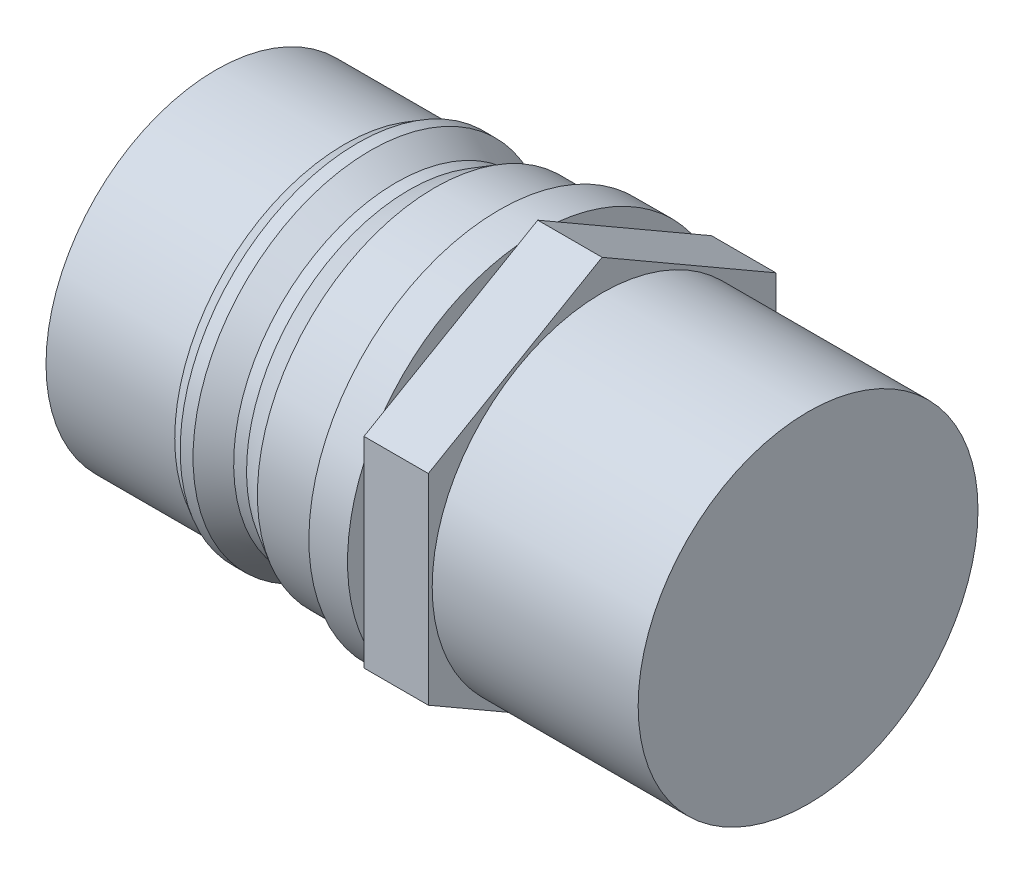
ISO-10303-21;
HEADER;
FILE_DESCRIPTION(('STEP AP214'),'2;1');
FILE_NAME('part.step','',(''),(''),'','','');
FILE_SCHEMA(('AUTOMOTIVE_DESIGN { 1 0 10303 214 1 1 1 1 }'));
ENDSEC;
DATA;
#1=APPLICATION_CONTEXT('core data for automotive mechanical design processes');
#2=APPLICATION_PROTOCOL_DEFINITION('international standard','automotive_design',2000,#1);
#3=PRODUCT_CONTEXT('',#1,'mechanical');
#4=PRODUCT('Part','Part','',(#3));
#5=PRODUCT_RELATED_PRODUCT_CATEGORY('part','',(#4));
#6=PRODUCT_DEFINITION_FORMATION('','',#4);
#7=PRODUCT_DEFINITION_CONTEXT('part definition',#1,'design');
#8=PRODUCT_DEFINITION('design','',#6,#7);
#9=PRODUCT_DEFINITION_SHAPE('','',#8);
#10=(LENGTH_UNIT() NAMED_UNIT(*) SI_UNIT(.MILLI.,.METRE.));
#11=(NAMED_UNIT(*) PLANE_ANGLE_UNIT() SI_UNIT($,.RADIAN.));
#12=(NAMED_UNIT(*) SI_UNIT($,.STERADIAN.) SOLID_ANGLE_UNIT());
#13=UNCERTAINTY_MEASURE_WITH_UNIT(LENGTH_MEASURE(1.E-05),#10,'distance_accuracy_value','');
#14=(GEOMETRIC_REPRESENTATION_CONTEXT(3) GLOBAL_UNCERTAINTY_ASSIGNED_CONTEXT((#13)) GLOBAL_UNIT_ASSIGNED_CONTEXT((#10,
#11,#12)) REPRESENTATION_CONTEXT('',''));
#15=CARTESIAN_POINT('',(0.,0.,0.));
#16=DIRECTION('',(0.,0.,1.));
#17=DIRECTION('',(1.,0.,0.));
#18=AXIS2_PLACEMENT_3D('',#15,#16,#17);
#19=CARTESIAN_POINT('',(25.,14.7773502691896,0.));
#20=DIRECTION('',(1.,0.,0.));
#21=DIRECTION('',(0.,1.,0.));
#22=AXIS2_PLACEMENT_3D('',#19,#20,#21);
#23=PLANE('',#22);
#24=DIRECTION('',(0.,0.5,0.866025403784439));
#25=VECTOR('',#24,1.);
#26=CARTESIAN_POINT('',(25.,7.79422863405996,-13.5));
#27=LINE('',#26,#25);
#28=CARTESIAN_POINT('',(25.,8.68634374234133,-11.9548113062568));
#29=VERTEX_POINT('',#28);
#30=CARTESIAN_POINT('',(25.,14.6963421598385,-1.54518869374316));
#31=VERTEX_POINT('',#30);
#32=EDGE_CURVE('E11',#29,#31,#27,.T.);
#33=ORIENTED_EDGE('',*,*,#32,.F.);
#34=CARTESIAN_POINT('',(25.,0.,0.));
#35=DIRECTION('',(1.,0.,0.));
#36=DIRECTION('',(0.,1.,0.));
#37=AXIS2_PLACEMENT_3D('',#34,#35,#36);
#38=CIRCLE('',#37,14.7773502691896);
#39=EDGE_CURVE('E152',#29,#31,#38,.T.);
#40=ORIENTED_EDGE('',*,*,#39,.T.);
#41=EDGE_LOOP('',(#33,#40));
#42=FACE_BOUND('',#41,.T.);
#43=ADVANCED_FACE('F33',(#42),#23,.T.);
#44=DIRECTION('',(0.,1.,0.));
#45=VECTOR('',#44,1.);
#46=CARTESIAN_POINT('',(25.,-7.79422863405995,-13.5));
#47=LINE('',#46,#45);
#48=CARTESIAN_POINT('',(25.,-6.0099984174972,-13.5));
#49=VERTEX_POINT('',#48);
#50=CARTESIAN_POINT('',(25.,6.00999841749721,-13.5));
#51=VERTEX_POINT('',#50);
#52=EDGE_CURVE('E42',#49,#51,#47,.T.);
#53=ORIENTED_EDGE('',*,*,#52,.F.);
#54=EDGE_CURVE('E316',#49,#51,#38,.T.);
#55=ORIENTED_EDGE('',*,*,#54,.T.);
#56=EDGE_LOOP('',(#53,#55));
#57=FACE_BOUND('',#56,.T.);
#58=ADVANCED_FACE('F226',(#57),#23,.T.);
#59=DIRECTION('',(0.,0.5,-0.866025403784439));
#60=VECTOR('',#59,1.);
#61=CARTESIAN_POINT('',(25.,-15.5884572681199,0.));
#62=LINE('',#61,#60);
#63=CARTESIAN_POINT('',(25.,-14.6963421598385,-1.54518869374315));
#64=VERTEX_POINT('',#63);
#65=CARTESIAN_POINT('',(25.,-8.68634374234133,-11.9548113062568));
#66=VERTEX_POINT('',#65);
#67=EDGE_CURVE('E284',#64,#66,#62,.T.);
#68=ORIENTED_EDGE('',*,*,#67,.F.);
#69=EDGE_CURVE('E307',#64,#66,#38,.T.);
#70=ORIENTED_EDGE('',*,*,#69,.T.);
#71=EDGE_LOOP('',(#68,#70));
#72=FACE_BOUND('',#71,.T.);
#73=ADVANCED_FACE('F232',(#72),#23,.T.);
#74=DIRECTION('',(0.,-0.5,-0.866025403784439));
#75=VECTOR('',#74,1.);
#76=CARTESIAN_POINT('',(25.,-7.79422863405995,13.5));
#77=LINE('',#76,#75);
#78=CARTESIAN_POINT('',(25.,-8.68634374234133,11.9548113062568));
#79=VERTEX_POINT('',#78);
#80=CARTESIAN_POINT('',(25.,-14.6963421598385,1.54518869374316));
#81=VERTEX_POINT('',#80);
#82=EDGE_CURVE('E194',#79,#81,#77,.T.);
#83=ORIENTED_EDGE('',*,*,#82,.F.);
#84=EDGE_CURVE('E302',#79,#81,#38,.T.);
#85=ORIENTED_EDGE('',*,*,#84,.T.);
#86=EDGE_LOOP('',(#83,#85));
#87=FACE_BOUND('',#86,.T.);
#88=ADVANCED_FACE('F252',(#87),#23,.T.);
#89=DIRECTION('',(0.,-1.,0.));
#90=VECTOR('',#89,1.);
#91=CARTESIAN_POINT('',(25.,7.79422863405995,13.5));
#92=LINE('',#91,#90);
#93=CARTESIAN_POINT('',(25.,6.0099984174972,13.5));
#94=VERTEX_POINT('',#93);
#95=CARTESIAN_POINT('',(25.,-6.0099984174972,13.5));
#96=VERTEX_POINT('',#95);
#97=EDGE_CURVE('E189',#94,#96,#92,.T.);
#98=ORIENTED_EDGE('',*,*,#97,.F.);
#99=EDGE_CURVE('E263',#94,#96,#38,.T.);
#100=ORIENTED_EDGE('',*,*,#99,.T.);
#101=EDGE_LOOP('',(#98,#100));
#102=FACE_BOUND('',#101,.T.);
#103=ADVANCED_FACE('F240',(#102),#23,.T.);
#104=CARTESIAN_POINT('',(0.,0.,0.));
#105=DIRECTION('',(-1.,0.,0.));
#106=DIRECTION('',(0.,-1.,0.));
#107=AXIS2_PLACEMENT_3D('',#104,#105,#106);
#108=PLANE('',#107);
#109=CARTESIAN_POINT('',(0.,0.,0.));
#110=DIRECTION('',(1.,0.,0.));
#111=DIRECTION('',(0.,1.,0.));
#112=AXIS2_PLACEMENT_3D('',#109,#110,#111);
#113=CIRCLE('',#112,13.2);
#114=CARTESIAN_POINT('',(0.,13.2,0.));
#115=VERTEX_POINT('',#114);
#116=EDGE_CURVE('E37',#115,#115,#113,.T.);
#117=ORIENTED_EDGE('',*,*,#116,.F.);
#118=EDGE_LOOP('',(#117));
#119=FACE_BOUND('',#118,.T.);
#120=ADVANCED_FACE('F35',(#119),#108,.T.);
#121=CARTESIAN_POINT('',(25.,0.,0.));
#122=DIRECTION('',(1.,0.,0.));
#123=DIRECTION('',(0.,1.,0.));
#124=AXIS2_PLACEMENT_3D('',#121,#122,#123);
#125=CYLINDRICAL_SURFACE('',#124,13.2);
#126=ORIENTED_EDGE('',*,*,#116,.T.);
#127=EDGE_LOOP('',(#126));
#128=FACE_BOUND('',#127,.T.);
#129=CARTESIAN_POINT('',(10.,0.,0.));
#130=DIRECTION('',(1.,0.,0.));
#131=DIRECTION('',(0.,1.,0.));
#132=AXIS2_PLACEMENT_3D('',#129,#130,#131);
#133=CIRCLE('',#132,13.2);
#134=CARTESIAN_POINT('',(10.,13.2,0.));
#135=VERTEX_POINT('',#134);
#136=EDGE_CURVE('E180',#135,#135,#133,.T.);
#137=ORIENTED_EDGE('',*,*,#136,.F.);
#138=EDGE_LOOP('',(#137));
#139=FACE_BOUND('',#138,.T.);
#140=ADVANCED_FACE('F258',(#128,#139),#125,.T.);
#141=CARTESIAN_POINT('',(11.,0.,0.));
#142=DIRECTION('',(1.,0.,0.));
#143=DIRECTION('',(0.,1.,0.));
#144=AXIS2_PLACEMENT_3D('',#141,#142,#143);
#145=CONICAL_SURFACE('',#144,13.7773502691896,0.523598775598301);
#146=ORIENTED_EDGE('',*,*,#136,.T.);
#147=EDGE_LOOP('',(#146));
#148=FACE_BOUND('',#147,.T.);
#149=CARTESIAN_POINT('',(11.,0.,0.));
#150=DIRECTION('',(1.,0.,0.));
#151=DIRECTION('',(0.,1.,0.));
#152=AXIS2_PLACEMENT_3D('',#149,#150,#151);
#153=CIRCLE('',#152,13.7773502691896);
#154=CARTESIAN_POINT('',(11.,13.7773502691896,0.));
#155=VERTEX_POINT('',#154);
#156=EDGE_CURVE('E178',#155,#155,#153,.T.);
#157=ORIENTED_EDGE('',*,*,#156,.F.);
#158=EDGE_LOOP('',(#157));
#159=FACE_BOUND('',#158,.T.);
#160=ADVANCED_FACE('F525',(#148,#159),#145,.T.);
#161=CARTESIAN_POINT('',(25.,0.,0.));
#162=DIRECTION('',(1.,0.,0.));
#163=DIRECTION('',(0.,1.,0.));
#164=AXIS2_PLACEMENT_3D('',#161,#162,#163);
#165=CYLINDRICAL_SURFACE('',#164,13.7773502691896);
#166=ORIENTED_EDGE('',*,*,#156,.T.);
#167=EDGE_LOOP('',(#166));
#168=FACE_BOUND('',#167,.T.);
#169=CARTESIAN_POINT('',(12.,0.,0.));
#170=DIRECTION('',(1.,0.,0.));
#171=DIRECTION('',(0.,1.,0.));
#172=AXIS2_PLACEMENT_3D('',#169,#170,#171);
#173=CIRCLE('',#172,13.7773502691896);
#174=CARTESIAN_POINT('',(12.,13.7773502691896,0.));
#175=VERTEX_POINT('',#174);
#176=EDGE_CURVE('E175',#175,#175,#173,.T.);
#177=ORIENTED_EDGE('',*,*,#176,.F.);
#178=EDGE_LOOP('',(#177));
#179=FACE_BOUND('',#178,.T.);
#180=ADVANCED_FACE('F514',(#168,#179),#165,.T.);
#181=CARTESIAN_POINT('',(14.,0.,0.));
#182=DIRECTION('',(-1.,0.,0.));
#183=DIRECTION('',(0.,-1.,0.));
#184=AXIS2_PLACEMENT_3D('',#181,#182,#183);
#185=CONICAL_SURFACE('',#184,12.6226497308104,0.5235987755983);
#186=ORIENTED_EDGE('',*,*,#176,.T.);
#187=EDGE_LOOP('',(#186));
#188=FACE_BOUND('',#187,.T.);
#189=CARTESIAN_POINT('',(14.,0.,0.));
#190=DIRECTION('',(1.,0.,0.));
#191=DIRECTION('',(0.,1.,0.));
#192=AXIS2_PLACEMENT_3D('',#189,#190,#191);
#193=CIRCLE('',#192,12.6226497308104);
#194=CARTESIAN_POINT('',(14.,12.6226497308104,0.));
#195=VERTEX_POINT('',#194);
#196=EDGE_CURVE('E172',#195,#195,#193,.T.);
#197=ORIENTED_EDGE('',*,*,#196,.F.);
#198=EDGE_LOOP('',(#197));
#199=FACE_BOUND('',#198,.T.);
#200=ADVANCED_FACE('F504',(#188,#199),#185,.T.);
#201=CARTESIAN_POINT('',(25.,0.,0.));
#202=DIRECTION('',(1.,0.,0.));
#203=DIRECTION('',(0.,1.,0.));
#204=AXIS2_PLACEMENT_3D('',#201,#202,#203);
#205=CYLINDRICAL_SURFACE('',#204,12.6226497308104);
#206=ORIENTED_EDGE('',*,*,#196,.T.);
#207=EDGE_LOOP('',(#206));
#208=FACE_BOUND('',#207,.T.);
#209=CARTESIAN_POINT('',(15.,0.,0.));
#210=DIRECTION('',(1.,0.,0.));
#211=DIRECTION('',(0.,1.,0.));
#212=AXIS2_PLACEMENT_3D('',#209,#210,#211);
#213=CIRCLE('',#212,12.6226497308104);
#214=CARTESIAN_POINT('',(15.,12.6226497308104,0.));
#215=VERTEX_POINT('',#214);
#216=EDGE_CURVE('E169',#215,#215,#213,.T.);
#217=ORIENTED_EDGE('',*,*,#216,.F.);
#218=EDGE_LOOP('',(#217));
#219=FACE_BOUND('',#218,.T.);
#220=ADVANCED_FACE('F492',(#208,#219),#205,.T.);
#221=CARTESIAN_POINT('',(17.,0.,0.));
#222=DIRECTION('',(1.,0.,0.));
#223=DIRECTION('',(0.,1.,0.));
#224=AXIS2_PLACEMENT_3D('',#221,#222,#223);
#225=CONICAL_SURFACE('',#224,13.7773502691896,0.5235987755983);
#226=ORIENTED_EDGE('',*,*,#216,.T.);
#227=EDGE_LOOP('',(#226));
#228=FACE_BOUND('',#227,.T.);
#229=CARTESIAN_POINT('',(17.,0.,0.));
#230=DIRECTION('',(1.,0.,0.));
#231=DIRECTION('',(0.,1.,0.));
#232=AXIS2_PLACEMENT_3D('',#229,#230,#231);
#233=CIRCLE('',#232,13.7773502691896);
#234=CARTESIAN_POINT('',(17.,13.7773502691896,0.));
#235=VERTEX_POINT('',#234);
#236=EDGE_CURVE('E166',#235,#235,#233,.T.);
#237=ORIENTED_EDGE('',*,*,#236,.F.);
#238=EDGE_LOOP('',(#237));
#239=FACE_BOUND('',#238,.T.);
#240=ADVANCED_FACE('F483',(#228,#239),#225,.T.);
#241=CARTESIAN_POINT('',(25.,0.,0.));
#242=DIRECTION('',(1.,0.,0.));
#243=DIRECTION('',(0.,1.,0.));
#244=AXIS2_PLACEMENT_3D('',#241,#242,#243);
#245=CYLINDRICAL_SURFACE('',#244,13.7773502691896);
#246=ORIENTED_EDGE('',*,*,#236,.T.);
#247=EDGE_LOOP('',(#246));
#248=FACE_BOUND('',#247,.T.);
#249=CARTESIAN_POINT('',(22.,0.,0.));
#250=DIRECTION('',(1.,0.,0.));
#251=DIRECTION('',(0.,1.,0.));
#252=AXIS2_PLACEMENT_3D('',#249,#250,#251);
#253=CIRCLE('',#252,13.7773502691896);
#254=CARTESIAN_POINT('',(22.,13.7773502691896,0.));
#255=VERTEX_POINT('',#254);
#256=EDGE_CURVE('E163',#255,#255,#253,.T.);
#257=ORIENTED_EDGE('',*,*,#256,.F.);
#258=EDGE_LOOP('',(#257));
#259=FACE_BOUND('',#258,.T.);
#260=ADVANCED_FACE('F474',(#248,#259),#245,.T.);
#261=CARTESIAN_POINT('',(22.,13.7773502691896,0.));
#262=DIRECTION('',(-1.,0.,0.));
#263=DIRECTION('',(0.,-1.,0.));
#264=AXIS2_PLACEMENT_3D('',#261,#262,#263);
#265=PLANE('',#264);
#266=ORIENTED_EDGE('',*,*,#256,.T.);
#267=EDGE_LOOP('',(#266));
#268=FACE_BOUND('',#267,.T.);
#269=CARTESIAN_POINT('',(22.,0.,0.));
#270=DIRECTION('',(1.,0.,0.));
#271=DIRECTION('',(0.,1.,0.));
#272=AXIS2_PLACEMENT_3D('',#269,#270,#271);
#273=CIRCLE('',#272,14.7773502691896);
#274=CARTESIAN_POINT('',(22.,14.7773502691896,0.));
#275=VERTEX_POINT('',#274);
#276=EDGE_CURVE('E159',#275,#275,#273,.T.);
#277=ORIENTED_EDGE('',*,*,#276,.F.);
#278=EDGE_LOOP('',(#277));
#279=FACE_BOUND('',#278,.T.);
#280=ADVANCED_FACE('F249',(#268,#279),#265,.T.);
#281=CARTESIAN_POINT('',(25.,0.,0.));
#282=DIRECTION('',(1.,0.,0.));
#283=DIRECTION('',(0.,1.,0.));
#284=AXIS2_PLACEMENT_3D('',#281,#282,#283);
#285=CYLINDRICAL_SURFACE('',#284,14.7773502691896);
#286=ORIENTED_EDGE('',*,*,#276,.T.);
#287=EDGE_LOOP('',(#286));
#288=FACE_BOUND('',#287,.T.);
#289=CARTESIAN_POINT('',(25.,14.6963421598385,1.54518869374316));
#290=VERTEX_POINT('',#289);
#291=CARTESIAN_POINT('',(25.,8.68634374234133,11.9548113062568));
#292=VERTEX_POINT('',#291);
#293=EDGE_CURVE('E154',#290,#292,#38,.T.);
#294=ORIENTED_EDGE('',*,*,#293,.F.);
#295=EDGE_CURVE('E52',#31,#290,#38,.T.);
#296=ORIENTED_EDGE('',*,*,#295,.F.);
#297=ORIENTED_EDGE('',*,*,#39,.F.);
#298=EDGE_CURVE('E320',#51,#29,#38,.T.);
#299=ORIENTED_EDGE('',*,*,#298,.F.);
#300=ORIENTED_EDGE('',*,*,#54,.F.);
#301=EDGE_CURVE('E311',#66,#49,#38,.T.);
#302=ORIENTED_EDGE('',*,*,#301,.F.);
#303=ORIENTED_EDGE('',*,*,#69,.F.);
#304=EDGE_CURVE('E304',#81,#64,#38,.T.);
#305=ORIENTED_EDGE('',*,*,#304,.F.);
#306=ORIENTED_EDGE('',*,*,#84,.F.);
#307=EDGE_CURVE('E271',#96,#79,#38,.T.);
#308=ORIENTED_EDGE('',*,*,#307,.F.);
#309=ORIENTED_EDGE('',*,*,#99,.F.);
#310=EDGE_CURVE('E160',#292,#94,#38,.T.);
#311=ORIENTED_EDGE('',*,*,#310,.F.);
#312=EDGE_LOOP('',(#294,#296,#297,#299,#300,#302,#303,#305,#306,#308,#309,#311));
#313=FACE_BOUND('',#312,.T.);
#314=ADVANCED_FACE('F238',(#288,#313),#285,.T.);
#315=DIRECTION('',(0.,-0.5,0.866025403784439));
#316=VECTOR('',#315,1.);
#317=CARTESIAN_POINT('',(25.,15.5884572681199,0.));
#318=LINE('',#317,#316);
#319=EDGE_CURVE('E185',#290,#292,#318,.T.);
#320=ORIENTED_EDGE('',*,*,#319,.F.);
#321=ORIENTED_EDGE('',*,*,#293,.T.);
#322=EDGE_LOOP('',(#320,#321));
#323=FACE_BOUND('',#322,.T.);
#324=ADVANCED_FACE('F228',(#323),#23,.T.);
#325=CARTESIAN_POINT('',(25.,0.,0.));
#326=DIRECTION('',(1.,0.,0.));
#327=DIRECTION('',(0.,0.,-1.));
#328=AXIS2_PLACEMENT_3D('',#325,#326,#327);
#329=PLANE('',#328);
#330=CARTESIAN_POINT('',(25.,7.79422863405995,13.5));
#331=VERTEX_POINT('',#330);
#332=EDGE_CURVE('E192',#292,#331,#318,.T.);
#333=ORIENTED_EDGE('',*,*,#332,.F.);
#334=ORIENTED_EDGE('',*,*,#310,.T.);
#335=EDGE_CURVE('E196',#331,#94,#92,.T.);
#336=ORIENTED_EDGE('',*,*,#335,.F.);
#337=EDGE_LOOP('',(#333,#334,#336));
#338=FACE_BOUND('',#337,.T.);
#339=ADVANCED_FACE('F237',(#338),#329,.F.);
#340=CARTESIAN_POINT('',(25.,-7.79422863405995,13.5));
#341=VERTEX_POINT('',#340);
#342=EDGE_CURVE('E197',#96,#341,#92,.T.);
#343=ORIENTED_EDGE('',*,*,#342,.F.);
#344=ORIENTED_EDGE('',*,*,#307,.T.);
#345=EDGE_CURVE('E275',#341,#79,#77,.T.);
#346=ORIENTED_EDGE('',*,*,#345,.F.);
#347=EDGE_LOOP('',(#343,#344,#346));
#348=FACE_BOUND('',#347,.T.);
#349=ADVANCED_FACE('F245',(#348),#329,.F.);
#350=CARTESIAN_POINT('',(25.,-15.5884572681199,0.));
#351=VERTEX_POINT('',#350);
#352=EDGE_CURVE('E274',#81,#351,#77,.T.);
#353=ORIENTED_EDGE('',*,*,#352,.F.);
#354=ORIENTED_EDGE('',*,*,#304,.T.);
#355=EDGE_CURVE('E280',#351,#64,#62,.T.);
#356=ORIENTED_EDGE('',*,*,#355,.F.);
#357=EDGE_LOOP('',(#353,#354,#356));
#358=FACE_BOUND('',#357,.T.);
#359=ADVANCED_FACE('F417',(#358),#329,.F.);
#360=CARTESIAN_POINT('',(25.,-7.79422863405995,-13.5));
#361=VERTEX_POINT('',#360);
#362=EDGE_CURVE('E279',#66,#361,#62,.T.);
#363=ORIENTED_EDGE('',*,*,#362,.F.);
#364=ORIENTED_EDGE('',*,*,#301,.T.);
#365=EDGE_CURVE('E145',#361,#49,#47,.T.);
#366=ORIENTED_EDGE('',*,*,#365,.F.);
#367=EDGE_LOOP('',(#363,#364,#366));
#368=FACE_BOUND('',#367,.T.);
#369=ADVANCED_FACE('F332',(#368),#329,.F.);
#370=CARTESIAN_POINT('',(25.,7.79422863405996,-13.5));
#371=VERTEX_POINT('',#370);
#372=EDGE_CURVE('E283',#51,#371,#47,.T.);
#373=ORIENTED_EDGE('',*,*,#372,.F.);
#374=ORIENTED_EDGE('',*,*,#298,.T.);
#375=EDGE_CURVE('E44',#371,#29,#27,.T.);
#376=ORIENTED_EDGE('',*,*,#375,.F.);
#377=EDGE_LOOP('',(#373,#374,#376));
#378=FACE_BOUND('',#377,.T.);
#379=ADVANCED_FACE('F327',(#378),#329,.F.);
#380=CARTESIAN_POINT('',(25.,15.5884572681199,0.));
#381=VERTEX_POINT('',#380);
#382=EDGE_CURVE('E45',#31,#381,#27,.T.);
#383=ORIENTED_EDGE('',*,*,#382,.F.);
#384=ORIENTED_EDGE('',*,*,#295,.T.);
#385=EDGE_CURVE('E191',#381,#290,#318,.T.);
#386=ORIENTED_EDGE('',*,*,#385,.F.);
#387=EDGE_LOOP('',(#383,#384,#386));
#388=FACE_BOUND('',#387,.T.);
#389=ADVANCED_FACE('F248',(#388),#329,.F.);
#390=CARTESIAN_POINT('',(30.,7.79422863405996,-13.5));
#391=DIRECTION('',(0.,-0.866025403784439,0.5));
#392=DIRECTION('',(0.,-0.5,-0.866025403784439));
#393=AXIS2_PLACEMENT_3D('',#390,#391,#392);
#394=PLANE('',#393);
#395=ORIENTED_EDGE('',*,*,#375,.T.);
#396=ORIENTED_EDGE('',*,*,#32,.T.);
#397=ORIENTED_EDGE('',*,*,#382,.T.);
#398=DIRECTION('',(-1.,0.,0.));
#399=VECTOR('',#398,1.);
#400=CARTESIAN_POINT('',(30.,15.5884572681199,0.));
#401=LINE('',#400,#399);
#402=CARTESIAN_POINT('',(30.,15.5884572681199,0.));
#403=VERTEX_POINT('',#402);
#404=EDGE_CURVE('E130',#403,#381,#401,.T.);
#405=ORIENTED_EDGE('',*,*,#404,.F.);
#406=DIRECTION('',(0.,0.5,0.866025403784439));
#407=VECTOR('',#406,1.);
#408=CARTESIAN_POINT('',(30.,7.79422863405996,-13.5));
#409=LINE('',#408,#407);
#410=CARTESIAN_POINT('',(30.,7.79422863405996,-13.5));
#411=VERTEX_POINT('',#410);
#412=EDGE_CURVE('E136',#411,#403,#409,.T.);
#413=ORIENTED_EDGE('',*,*,#412,.F.);
#414=DIRECTION('',(-1.,0.,0.));
#415=VECTOR('',#414,1.);
#416=CARTESIAN_POINT('',(30.,7.79422863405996,-13.5));
#417=LINE('',#416,#415);
#418=EDGE_CURVE('E203',#411,#371,#417,.T.);
#419=ORIENTED_EDGE('',*,*,#418,.T.);
#420=EDGE_LOOP('',(#395,#396,#397,#405,#413,#419));
#421=FACE_BOUND('',#420,.T.);
#422=ADVANCED_FACE('F148',(#421),#394,.F.);
#423=CARTESIAN_POINT('',(30.,15.5884572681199,0.));
#424=DIRECTION('',(0.,-0.866025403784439,-0.5));
#425=DIRECTION('',(0.,0.5,-0.866025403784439));
#426=AXIS2_PLACEMENT_3D('',#423,#424,#425);
#427=PLANE('',#426);
#428=ORIENTED_EDGE('',*,*,#385,.T.);
#429=ORIENTED_EDGE('',*,*,#319,.T.);
#430=ORIENTED_EDGE('',*,*,#332,.T.);
#431=DIRECTION('',(-1.,0.,0.));
#432=VECTOR('',#431,1.);
#433=CARTESIAN_POINT('',(30.,7.79422863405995,13.5));
#434=LINE('',#433,#432);
#435=CARTESIAN_POINT('',(30.,7.79422863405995,13.5));
#436=VERTEX_POINT('',#435);
#437=EDGE_CURVE('E132',#436,#331,#434,.T.);
#438=ORIENTED_EDGE('',*,*,#437,.F.);
#439=DIRECTION('',(0.,-0.5,0.866025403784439));
#440=VECTOR('',#439,1.);
#441=CARTESIAN_POINT('',(30.,15.5884572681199,0.));
#442=LINE('',#441,#440);
#443=EDGE_CURVE('E125',#403,#436,#442,.T.);
#444=ORIENTED_EDGE('',*,*,#443,.F.);
#445=ORIENTED_EDGE('',*,*,#404,.T.);
#446=EDGE_LOOP('',(#428,#429,#430,#438,#444,#445));
#447=FACE_BOUND('',#446,.T.);
#448=ADVANCED_FACE('F128',(#447),#427,.F.);
#449=CARTESIAN_POINT('',(30.,7.79422863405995,13.5));
#450=DIRECTION('',(0.,0.,-1.));
#451=DIRECTION('',(-1.,0.,0.));
#452=AXIS2_PLACEMENT_3D('',#449,#450,#451);
#453=PLANE('',#452);
#454=ORIENTED_EDGE('',*,*,#335,.T.);
#455=ORIENTED_EDGE('',*,*,#97,.T.);
#456=ORIENTED_EDGE('',*,*,#342,.T.);
#457=DIRECTION('',(-1.,0.,0.));
#458=VECTOR('',#457,1.);
#459=CARTESIAN_POINT('',(30.,-7.79422863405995,13.5));
#460=LINE('',#459,#458);
#461=CARTESIAN_POINT('',(30.,-7.79422863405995,13.5));
#462=VERTEX_POINT('',#461);
#463=EDGE_CURVE('E155',#462,#341,#460,.T.);
#464=ORIENTED_EDGE('',*,*,#463,.F.);
#465=DIRECTION('',(0.,-1.,0.));
#466=VECTOR('',#465,1.);
#467=CARTESIAN_POINT('',(30.,7.79422863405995,13.5));
#468=LINE('',#467,#466);
#469=EDGE_CURVE('E135',#436,#462,#468,.T.);
#470=ORIENTED_EDGE('',*,*,#469,.F.);
#471=ORIENTED_EDGE('',*,*,#437,.T.);
#472=EDGE_LOOP('',(#454,#455,#456,#464,#470,#471));
#473=FACE_BOUND('',#472,.T.);
#474=ADVANCED_FACE('F273',(#473),#453,.F.);
#475=CARTESIAN_POINT('',(30.,-7.79422863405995,13.5));
#476=DIRECTION('',(0.,0.866025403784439,-0.5));
#477=DIRECTION('',(0.,0.5,0.866025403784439));
#478=AXIS2_PLACEMENT_3D('',#475,#476,#477);
#479=PLANE('',#478);
#480=ORIENTED_EDGE('',*,*,#345,.T.);
#481=ORIENTED_EDGE('',*,*,#82,.T.);
#482=ORIENTED_EDGE('',*,*,#352,.T.);
#483=DIRECTION('',(-1.,0.,0.));
#484=VECTOR('',#483,1.);
#485=CARTESIAN_POINT('',(30.,-15.5884572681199,0.));
#486=LINE('',#485,#484);
#487=CARTESIAN_POINT('',(30.,-15.5884572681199,0.));
#488=VERTEX_POINT('',#487);
#489=EDGE_CURVE('E291',#488,#351,#486,.T.);
#490=ORIENTED_EDGE('',*,*,#489,.F.);
#491=DIRECTION('',(0.,-0.5,-0.866025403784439));
#492=VECTOR('',#491,1.);
#493=CARTESIAN_POINT('',(30.,-7.79422863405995,13.5));
#494=LINE('',#493,#492);
#495=EDGE_CURVE('E206',#462,#488,#494,.T.);
#496=ORIENTED_EDGE('',*,*,#495,.F.);
#497=ORIENTED_EDGE('',*,*,#463,.T.);
#498=EDGE_LOOP('',(#480,#481,#482,#490,#496,#497));
#499=FACE_BOUND('',#498,.T.);
#500=ADVANCED_FACE('F298',(#499),#479,.F.);
#501=CARTESIAN_POINT('',(30.,-15.5884572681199,0.));
#502=DIRECTION('',(0.,0.866025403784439,0.5));
#503=DIRECTION('',(0.,-0.5,0.866025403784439));
#504=AXIS2_PLACEMENT_3D('',#501,#502,#503);
#505=PLANE('',#504);
#506=ORIENTED_EDGE('',*,*,#355,.T.);
#507=ORIENTED_EDGE('',*,*,#67,.T.);
#508=ORIENTED_EDGE('',*,*,#362,.T.);
#509=DIRECTION('',(-1.,0.,0.));
#510=VECTOR('',#509,1.);
#511=CARTESIAN_POINT('',(30.,-7.79422863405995,-13.5));
#512=LINE('',#511,#510);
#513=CARTESIAN_POINT('',(30.,-7.79422863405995,-13.5));
#514=VERTEX_POINT('',#513);
#515=EDGE_CURVE('E288',#514,#361,#512,.T.);
#516=ORIENTED_EDGE('',*,*,#515,.F.);
#517=DIRECTION('',(0.,0.5,-0.866025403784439));
#518=VECTOR('',#517,1.);
#519=CARTESIAN_POINT('',(30.,-15.5884572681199,0.));
#520=LINE('',#519,#518);
#521=EDGE_CURVE('E204',#488,#514,#520,.T.);
#522=ORIENTED_EDGE('',*,*,#521,.F.);
#523=ORIENTED_EDGE('',*,*,#489,.T.);
#524=EDGE_LOOP('',(#506,#507,#508,#516,#522,#523));
#525=FACE_BOUND('',#524,.T.);
#526=ADVANCED_FACE('F338',(#525),#505,.F.);
#527=CARTESIAN_POINT('',(30.,-7.79422863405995,-13.5));
#528=DIRECTION('',(0.,0.,1.));
#529=DIRECTION('',(0.,-1.,0.));
#530=AXIS2_PLACEMENT_3D('',#527,#528,#529);
#531=PLANE('',#530);
#532=ORIENTED_EDGE('',*,*,#365,.T.);
#533=ORIENTED_EDGE('',*,*,#52,.T.);
#534=ORIENTED_EDGE('',*,*,#372,.T.);
#535=ORIENTED_EDGE('',*,*,#418,.F.);
#536=DIRECTION('',(0.,1.,0.));
#537=VECTOR('',#536,1.);
#538=CARTESIAN_POINT('',(30.,-7.79422863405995,-13.5));
#539=LINE('',#538,#537);
#540=EDGE_CURVE('E141',#514,#411,#539,.T.);
#541=ORIENTED_EDGE('',*,*,#540,.F.);
#542=ORIENTED_EDGE('',*,*,#515,.T.);
#543=EDGE_LOOP('',(#532,#533,#534,#535,#541,#542));
#544=FACE_BOUND('',#543,.T.);
#545=ADVANCED_FACE('F335',(#544),#531,.F.);
#546=CARTESIAN_POINT('',(30.,0.,0.));
#547=DIRECTION('',(1.,0.,0.));
#548=DIRECTION('',(0.,0.,-1.));
#549=AXIS2_PLACEMENT_3D('',#546,#547,#548);
#550=PLANE('',#549);
#551=CARTESIAN_POINT('',(30.,0.,0.));
#552=DIRECTION('',(-1.,0.,0.));
#553=DIRECTION('',(0.,0.,1.));
#554=AXIS2_PLACEMENT_3D('',#551,#552,#553);
#555=CIRCLE('',#554,13.2);
#556=CARTESIAN_POINT('',(30.,0.,13.2));
#557=VERTEX_POINT('',#556);
#558=EDGE_CURVE('E200',#557,#557,#555,.T.);
#559=ORIENTED_EDGE('',*,*,#558,.T.);
#560=EDGE_LOOP('',(#559));
#561=FACE_BOUND('',#560,.T.);
#562=ORIENTED_EDGE('',*,*,#412,.T.);
#563=ORIENTED_EDGE('',*,*,#443,.T.);
#564=ORIENTED_EDGE('',*,*,#469,.T.);
#565=ORIENTED_EDGE('',*,*,#495,.T.);
#566=ORIENTED_EDGE('',*,*,#521,.T.);
#567=ORIENTED_EDGE('',*,*,#540,.T.);
#568=EDGE_LOOP('',(#562,#563,#564,#565,#566,#567));
#569=FACE_BOUND('',#568,.T.);
#570=ADVANCED_FACE('F139',(#561,#569),#550,.T.);
#571=CARTESIAN_POINT('',(30.,0.,0.));
#572=DIRECTION('',(-1.,0.,0.));
#573=DIRECTION('',(0.,0.,1.));
#574=AXIS2_PLACEMENT_3D('',#571,#572,#573);
#575=CYLINDRICAL_SURFACE('',#574,13.2);
#576=ORIENTED_EDGE('',*,*,#558,.F.);
#577=EDGE_LOOP('',(#576));
#578=FACE_BOUND('',#577,.T.);
#579=CARTESIAN_POINT('',(46.,0.,0.));
#580=DIRECTION('',(-1.,0.,0.));
#581=DIRECTION('',(0.,0.,1.));
#582=AXIS2_PLACEMENT_3D('',#579,#580,#581);
#583=CIRCLE('',#582,13.2);
#584=CARTESIAN_POINT('',(46.,0.,13.2));
#585=VERTEX_POINT('',#584);
#586=EDGE_CURVE('E211',#585,#585,#583,.T.);
#587=ORIENTED_EDGE('',*,*,#586,.T.);
#588=EDGE_LOOP('',(#587));
#589=FACE_BOUND('',#588,.T.);
#590=ADVANCED_FACE('F215',(#578,#589),#575,.T.);
#591=CARTESIAN_POINT('',(46.,13.2,0.));
#592=DIRECTION('',(-1.,0.,0.));
#593=DIRECTION('',(0.,0.,1.));
#594=AXIS2_PLACEMENT_3D('',#591,#592,#593);
#595=PLANE('',#594);
#596=ORIENTED_EDGE('',*,*,#586,.F.);
#597=EDGE_LOOP('',(#596));
#598=FACE_BOUND('',#597,.T.);
#599=ADVANCED_FACE('F217',(#598),#595,.F.);
#600=CLOSED_SHELL('',(#43,#58,#73,#88,#103,#120,#140,#160,#180,#200,#220,#240,#260,#280,#314,
#324,#339,#349,#359,#369,#379,#389,#422,#448,#474,#500,#526,#545,#570,#590,#599));
#601=MANIFOLD_SOLID_BREP('B2',#600);
#602=ADVANCED_BREP_SHAPE_REPRESENTATION('',(#18,#601),#14);
#603=SHAPE_DEFINITION_REPRESENTATION(#9,#602);
ENDSEC;
END-ISO-10303-21;
